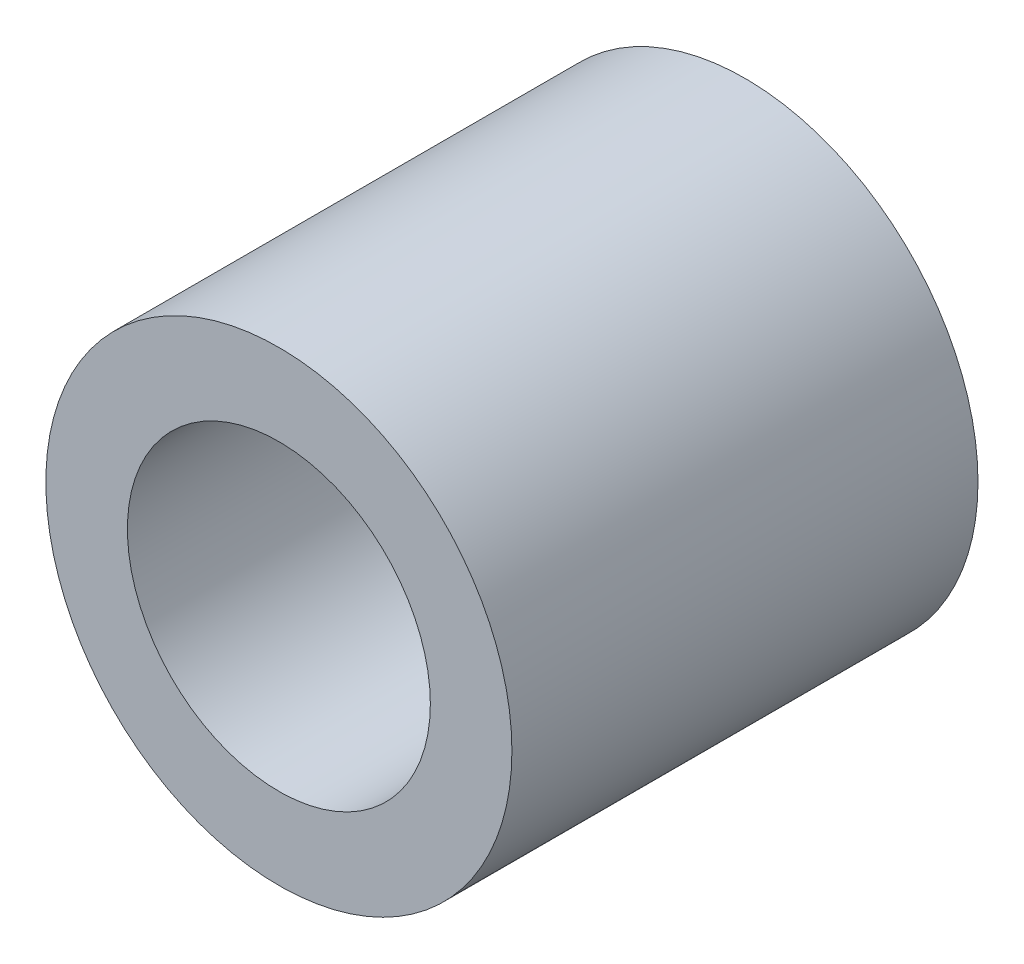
ISO-10303-21;
HEADER;
FILE_DESCRIPTION(('STEP AP214'),'2;1');
FILE_NAME('part.step','',(''),(''),'','','');
FILE_SCHEMA(('AUTOMOTIVE_DESIGN { 1 0 10303 214 1 1 1 1 }'));
ENDSEC;
DATA;
#1=APPLICATION_CONTEXT('core data for automotive mechanical design processes');
#2=APPLICATION_PROTOCOL_DEFINITION('international standard','automotive_design',2000,#1);
#3=PRODUCT_CONTEXT('',#1,'mechanical');
#4=PRODUCT('Part','Part','',(#3));
#5=PRODUCT_RELATED_PRODUCT_CATEGORY('part','',(#4));
#6=PRODUCT_DEFINITION_FORMATION('','',#4);
#7=PRODUCT_DEFINITION_CONTEXT('part definition',#1,'design');
#8=PRODUCT_DEFINITION('design','',#6,#7);
#9=PRODUCT_DEFINITION_SHAPE('','',#8);
#10=(LENGTH_UNIT() NAMED_UNIT(*) SI_UNIT(.MILLI.,.METRE.));
#11=(NAMED_UNIT(*) PLANE_ANGLE_UNIT() SI_UNIT($,.RADIAN.));
#12=(NAMED_UNIT(*) SI_UNIT($,.STERADIAN.) SOLID_ANGLE_UNIT());
#13=UNCERTAINTY_MEASURE_WITH_UNIT(LENGTH_MEASURE(1.E-05),#10,'distance_accuracy_value','');
#14=(GEOMETRIC_REPRESENTATION_CONTEXT(3) GLOBAL_UNCERTAINTY_ASSIGNED_CONTEXT((#13)) GLOBAL_UNIT_ASSIGNED_CONTEXT((#10,
#11,#12)) REPRESENTATION_CONTEXT('',''));
#15=CARTESIAN_POINT('',(0.,0.,0.));
#16=DIRECTION('',(0.,0.,1.));
#17=DIRECTION('',(1.,0.,0.));
#18=AXIS2_PLACEMENT_3D('',#15,#16,#17);
#19=CARTESIAN_POINT('',(0.,0.,10.));
#20=DIRECTION('',(0.,0.,1.));
#21=DIRECTION('',(1.,0.,0.));
#22=AXIS2_PLACEMENT_3D('',#19,#20,#21);
#23=PLANE('',#22);
#24=CARTESIAN_POINT('',(0.,0.,10.));
#25=DIRECTION('',(0.,0.,1.));
#26=DIRECTION('',(1.,0.,0.));
#27=AXIS2_PLACEMENT_3D('',#24,#25,#26);
#28=CIRCLE('',#27,5.);
#29=CARTESIAN_POINT('',(5.,0.,10.));
#30=VERTEX_POINT('',#29);
#31=EDGE_CURVE('E10',#30,#30,#28,.T.);
#32=ORIENTED_EDGE('',*,*,#31,.T.);
#33=EDGE_LOOP('',(#32));
#34=FACE_BOUND('',#33,.T.);
#35=CARTESIAN_POINT('',(0.,0.,10.));
#36=DIRECTION('',(0.,0.,1.));
#37=DIRECTION('',(1.,0.,0.));
#38=AXIS2_PLACEMENT_3D('',#35,#36,#37);
#39=CIRCLE('',#38,3.25);
#40=CARTESIAN_POINT('',(3.25,0.,10.));
#41=VERTEX_POINT('',#40);
#42=EDGE_CURVE('E40',#41,#41,#39,.T.);
#43=ORIENTED_EDGE('',*,*,#42,.F.);
#44=EDGE_LOOP('',(#43));
#45=FACE_BOUND('',#44,.T.);
#46=ADVANCED_FACE('F29',(#34,#45),#23,.T.);
#47=CARTESIAN_POINT('',(0.,0.,0.));
#48=DIRECTION('',(0.,0.,1.));
#49=DIRECTION('',(1.,0.,0.));
#50=AXIS2_PLACEMENT_3D('',#47,#48,#49);
#51=PLANE('',#50);
#52=CARTESIAN_POINT('',(0.,0.,0.));
#53=DIRECTION('',(0.,0.,1.));
#54=DIRECTION('',(1.,0.,0.));
#55=AXIS2_PLACEMENT_3D('',#52,#53,#54);
#56=CIRCLE('',#55,5.);
#57=CARTESIAN_POINT('',(5.,0.,0.));
#58=VERTEX_POINT('',#57);
#59=EDGE_CURVE('E33',#58,#58,#56,.T.);
#60=ORIENTED_EDGE('',*,*,#59,.F.);
#61=EDGE_LOOP('',(#60));
#62=FACE_BOUND('',#61,.T.);
#63=CARTESIAN_POINT('',(0.,0.,0.));
#64=DIRECTION('',(0.,0.,1.));
#65=DIRECTION('',(1.,0.,0.));
#66=AXIS2_PLACEMENT_3D('',#63,#64,#65);
#67=CIRCLE('',#66,3.25);
#68=CARTESIAN_POINT('',(3.25,0.,0.));
#69=VERTEX_POINT('',#68);
#70=EDGE_CURVE('E42',#69,#69,#67,.T.);
#71=ORIENTED_EDGE('',*,*,#70,.T.);
#72=EDGE_LOOP('',(#71));
#73=FACE_BOUND('',#72,.T.);
#74=ADVANCED_FACE('F52',(#62,#73),#51,.F.);
#75=CARTESIAN_POINT('',(0.,0.,10.));
#76=DIRECTION('',(0.,0.,-1.));
#77=DIRECTION('',(-1.,0.,0.));
#78=AXIS2_PLACEMENT_3D('',#75,#76,#77);
#79=CYLINDRICAL_SURFACE('',#78,5.);
#80=ORIENTED_EDGE('',*,*,#31,.F.);
#81=EDGE_LOOP('',(#80));
#82=FACE_BOUND('',#81,.T.);
#83=ORIENTED_EDGE('',*,*,#59,.T.);
#84=EDGE_LOOP('',(#83));
#85=FACE_BOUND('',#84,.T.);
#86=ADVANCED_FACE('F31',(#82,#85),#79,.T.);
#87=CARTESIAN_POINT('',(0.,0.,10.));
#88=DIRECTION('',(0.,0.,-1.));
#89=DIRECTION('',(-1.,0.,0.));
#90=AXIS2_PLACEMENT_3D('',#87,#88,#89);
#91=CYLINDRICAL_SURFACE('',#90,3.25);
#92=ORIENTED_EDGE('',*,*,#42,.T.);
#93=EDGE_LOOP('',(#92));
#94=FACE_BOUND('',#93,.T.);
#95=ORIENTED_EDGE('',*,*,#70,.F.);
#96=EDGE_LOOP('',(#95));
#97=FACE_BOUND('',#96,.T.);
#98=ADVANCED_FACE('F48',(#94,#97),#91,.F.);
#99=CLOSED_SHELL('',(#46,#74,#86,#98));
#100=MANIFOLD_SOLID_BREP('B2',#99);
#101=ADVANCED_BREP_SHAPE_REPRESENTATION('',(#18,#100),#14);
#102=SHAPE_DEFINITION_REPRESENTATION(#9,#101);
ENDSEC;
END-ISO-10303-21;
